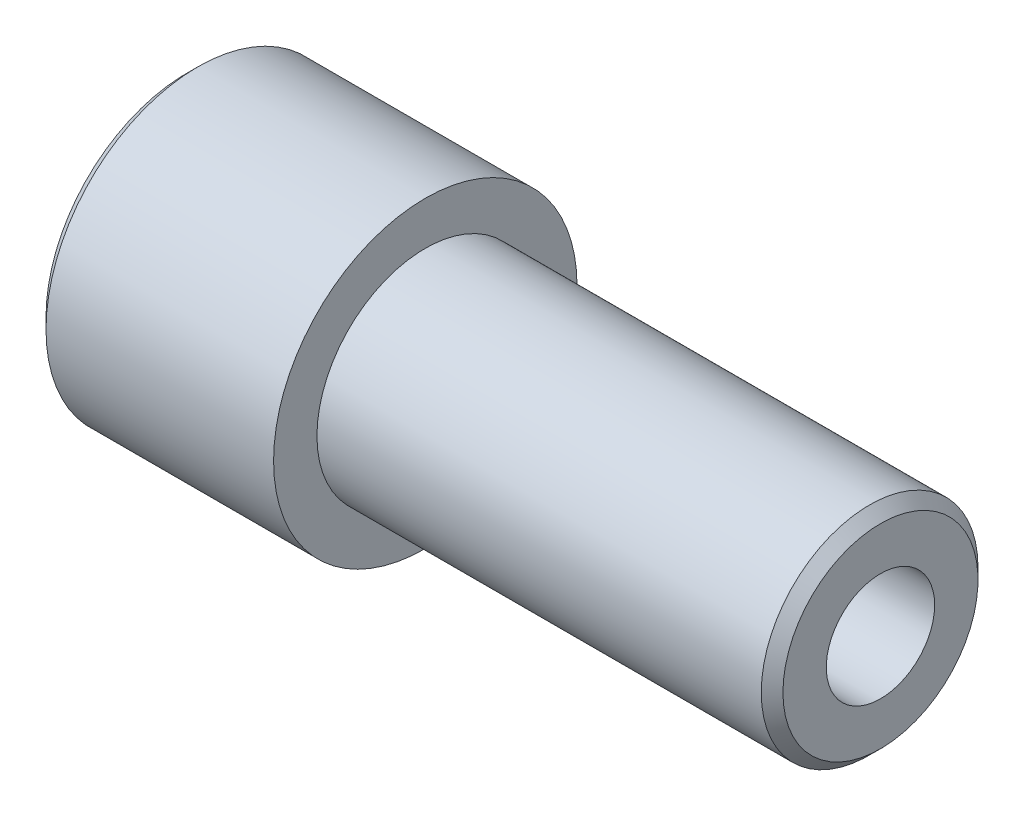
from build123d import *

# Parameters (mm, degrees)
TROU_TARAUD_M61_D     = 5
TROU_TARAUD_M61_DEPTH = 20
TROU_TARAUD_M61_TIP   = 1.502151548
CHANFREIN1_SIZE       = 0.5


with BuildPart() as part:
    # Esquisse1 → R_volution1 (revolve)
    with BuildSketch(Plane.XY, mode=Mode.PRIVATE) as r_volution1_sk:
        Polygon((0, 0), (0, 7), (11, 7), (11, 5), (32, 5), (32, 0), align=None)
    revolve(r_volution1_sk.sketch.rotate(Axis((0, 0, 0), (1, 0, 0)), 90), axis=Axis((0, 0, 0), (1, 0, 0)))

    # Trou taraud_ M61
    with Locations(Plane(origin=(32, 0, 0), x_dir=(0, 0, -1), z_dir=(1, 0, 0))):
        with Locations((0, 0)):
            Hole(TROU_TARAUD_M61_D / 2, depth=TROU_TARAUD_M61_DEPTH)
            with Locations((0, 0, -(TROU_TARAUD_M61_DEPTH + TROU_TARAUD_M61_TIP / 2))):  # 118° drill point
                Cone(0, TROU_TARAUD_M61_D / 2, TROU_TARAUD_M61_TIP, mode=Mode.SUBTRACT)

    # Chanfrein1
    chanfrein1_edges = [part.edges().sort_by_distance(p)[0] for p in [
        (32, 0, -5),
        (0, 0, -7),
    ]]
    chamfer(chanfrein1_edges, length=CHANFREIN1_SIZE)


solid = part.part
